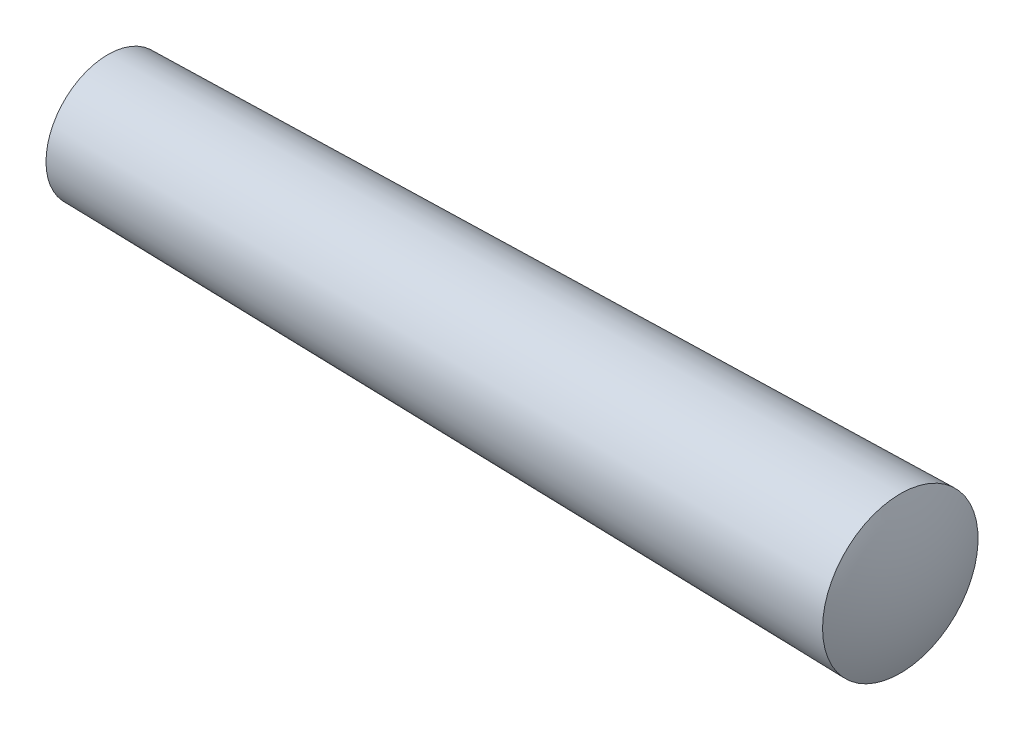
from build123d import *


with BuildPart() as part:
    # Sketch1 → Base-Revolve (revolve)
    with BuildSketch(Plane.XY):
        with BuildLine():
            Line((0, 0), (4, 0))
            ThreePointArc((4, 0), (3.979779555, 0.192599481), (3.92, 0.3768))
            Line((3.92, 0.3768), (0.08, 0.3))
            ThreePointArc((0.08, 0.3), (0.020343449, 0.155241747), (0, 0))
        make_face()
    revolve(axis=Axis((-4.003548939, 0, 0), (1, 0, 0)))


solid = part.part
